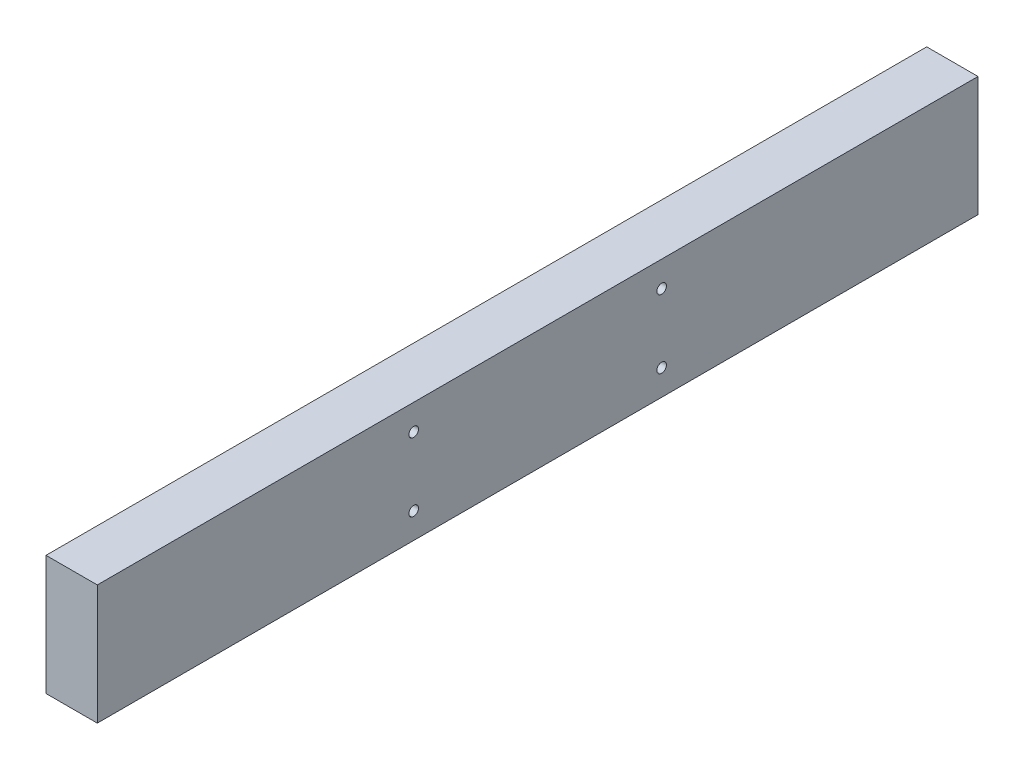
ISO-10303-21;
HEADER;
FILE_DESCRIPTION(('STEP AP214'),'2;1');
FILE_NAME('part.step','',(''),(''),'','','');
FILE_SCHEMA(('AUTOMOTIVE_DESIGN { 1 0 10303 214 1 1 1 1 }'));
ENDSEC;
DATA;
#1=APPLICATION_CONTEXT('core data for automotive mechanical design processes');
#2=APPLICATION_PROTOCOL_DEFINITION('international standard','automotive_design',2000,#1);
#3=PRODUCT_CONTEXT('',#1,'mechanical');
#4=PRODUCT('Part','Part','',(#3));
#5=PRODUCT_RELATED_PRODUCT_CATEGORY('part','',(#4));
#6=PRODUCT_DEFINITION_FORMATION('','',#4);
#7=PRODUCT_DEFINITION_CONTEXT('part definition',#1,'design');
#8=PRODUCT_DEFINITION('design','',#6,#7);
#9=PRODUCT_DEFINITION_SHAPE('','',#8);
#10=(LENGTH_UNIT() NAMED_UNIT(*) SI_UNIT(.MILLI.,.METRE.));
#11=(NAMED_UNIT(*) PLANE_ANGLE_UNIT() SI_UNIT($,.RADIAN.));
#12=(NAMED_UNIT(*) SI_UNIT($,.STERADIAN.) SOLID_ANGLE_UNIT());
#13=UNCERTAINTY_MEASURE_WITH_UNIT(LENGTH_MEASURE(1.E-05),#10,'distance_accuracy_value','');
#14=(GEOMETRIC_REPRESENTATION_CONTEXT(3) GLOBAL_UNCERTAINTY_ASSIGNED_CONTEXT((#13)) GLOBAL_UNIT_ASSIGNED_CONTEXT((#10,
#11,#12)) REPRESENTATION_CONTEXT('',''));
#15=CARTESIAN_POINT('',(0.,0.,0.));
#16=DIRECTION('',(0.,0.,1.));
#17=DIRECTION('',(1.,0.,0.));
#18=AXIS2_PLACEMENT_3D('',#15,#16,#17);
#19=CARTESIAN_POINT('',(19.05,-44.45,654.05));
#20=DIRECTION('',(-1.,0.,0.));
#21=DIRECTION('',(0.,0.,1.));
#22=AXIS2_PLACEMENT_3D('',#19,#20,#21);
#23=PLANE('',#22);
#24=CARTESIAN_POINT('',(19.05,25.4,234.95));
#25=DIRECTION('',(-1.,0.,0.));
#26=DIRECTION('',(0.,0.,1.));
#27=AXIS2_PLACEMENT_3D('',#24,#25,#26);
#28=CIRCLE('',#27,3.57187499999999);
#29=CARTESIAN_POINT('',(19.05,25.4,238.521875));
#30=VERTEX_POINT('',#29);
#31=EDGE_CURVE('E127',#30,#30,#28,.T.);
#32=ORIENTED_EDGE('',*,*,#31,.T.);
#33=EDGE_LOOP('',(#32));
#34=FACE_BOUND('',#33,.T.);
#35=CARTESIAN_POINT('',(19.05,25.4,419.1));
#36=DIRECTION('',(-1.,0.,0.));
#37=DIRECTION('',(0.,0.,1.));
#38=AXIS2_PLACEMENT_3D('',#35,#36,#37);
#39=CIRCLE('',#38,3.57187499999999);
#40=CARTESIAN_POINT('',(19.05,25.4,422.671875));
#41=VERTEX_POINT('',#40);
#42=EDGE_CURVE('E121',#41,#41,#39,.T.);
#43=ORIENTED_EDGE('',*,*,#42,.T.);
#44=EDGE_LOOP('',(#43));
#45=FACE_BOUND('',#44,.T.);
#46=CARTESIAN_POINT('',(19.05,-25.4,419.1));
#47=DIRECTION('',(-1.,0.,0.));
#48=DIRECTION('',(0.,0.,1.));
#49=AXIS2_PLACEMENT_3D('',#46,#47,#48);
#50=CIRCLE('',#49,3.57187499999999);
#51=CARTESIAN_POINT('',(19.05,-25.4,422.671875));
#52=VERTEX_POINT('',#51);
#53=EDGE_CURVE('E115',#52,#52,#50,.T.);
#54=ORIENTED_EDGE('',*,*,#53,.T.);
#55=EDGE_LOOP('',(#54));
#56=FACE_BOUND('',#55,.T.);
#57=CARTESIAN_POINT('',(19.05,-25.4,234.95));
#58=DIRECTION('',(-1.,0.,0.));
#59=DIRECTION('',(0.,0.,1.));
#60=AXIS2_PLACEMENT_3D('',#57,#58,#59);
#61=CIRCLE('',#60,3.57187499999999);
#62=CARTESIAN_POINT('',(19.05,-25.4,238.521875));
#63=VERTEX_POINT('',#62);
#64=EDGE_CURVE('E99',#63,#63,#61,.T.);
#65=ORIENTED_EDGE('',*,*,#64,.T.);
#66=EDGE_LOOP('',(#65));
#67=FACE_BOUND('',#66,.T.);
#68=DIRECTION('',(0.,1.,0.));
#69=VECTOR('',#68,1.);
#70=CARTESIAN_POINT('',(19.05,-44.45,0.));
#71=LINE('',#70,#69);
#72=CARTESIAN_POINT('',(19.05,-44.45,0.));
#73=VERTEX_POINT('',#72);
#74=CARTESIAN_POINT('',(19.05,44.45,0.));
#75=VERTEX_POINT('',#74);
#76=EDGE_CURVE('E96',#73,#75,#71,.T.);
#77=ORIENTED_EDGE('',*,*,#76,.T.);
#78=DIRECTION('',(0.,0.,-1.));
#79=VECTOR('',#78,1.);
#80=CARTESIAN_POINT('',(19.05,44.45,654.05));
#81=LINE('',#80,#79);
#82=CARTESIAN_POINT('',(19.05,44.45,654.05));
#83=VERTEX_POINT('',#82);
#84=EDGE_CURVE('E11',#83,#75,#81,.T.);
#85=ORIENTED_EDGE('',*,*,#84,.F.);
#86=DIRECTION('',(0.,1.,0.));
#87=VECTOR('',#86,1.);
#88=CARTESIAN_POINT('',(19.05,-44.45,654.05));
#89=LINE('',#88,#87);
#90=CARTESIAN_POINT('',(19.05,-44.45,654.05));
#91=VERTEX_POINT('',#90);
#92=EDGE_CURVE('E84',#91,#83,#89,.T.);
#93=ORIENTED_EDGE('',*,*,#92,.F.);
#94=DIRECTION('',(0.,0.,-1.));
#95=VECTOR('',#94,1.);
#96=CARTESIAN_POINT('',(19.05,-44.45,654.05));
#97=LINE('',#96,#95);
#98=EDGE_CURVE('E92',#91,#73,#97,.T.);
#99=ORIENTED_EDGE('',*,*,#98,.T.);
#100=EDGE_LOOP('',(#77,#85,#93,#99));
#101=FACE_BOUND('',#100,.T.);
#102=ADVANCED_FACE('F33',(#34,#45,#56,#67,#101),#23,.F.);
#103=CARTESIAN_POINT('',(-19.05,44.45,654.05));
#104=DIRECTION('',(0.,-1.,0.));
#105=DIRECTION('',(0.,0.,-1.));
#106=AXIS2_PLACEMENT_3D('',#103,#104,#105);
#107=PLANE('',#106);
#108=DIRECTION('',(-1.,0.,0.));
#109=VECTOR('',#108,1.);
#110=CARTESIAN_POINT('',(-19.05,44.45,0.));
#111=LINE('',#110,#109);
#112=CARTESIAN_POINT('',(-19.05,44.45,0.));
#113=VERTEX_POINT('',#112);
#114=EDGE_CURVE('E88',#75,#113,#111,.T.);
#115=ORIENTED_EDGE('',*,*,#114,.T.);
#116=DIRECTION('',(0.,0.,-1.));
#117=VECTOR('',#116,1.);
#118=CARTESIAN_POINT('',(-19.05,44.45,654.05));
#119=LINE('',#118,#117);
#120=CARTESIAN_POINT('',(-19.05,44.45,654.05));
#121=VERTEX_POINT('',#120);
#122=EDGE_CURVE('E41',#121,#113,#119,.T.);
#123=ORIENTED_EDGE('',*,*,#122,.F.);
#124=DIRECTION('',(-1.,0.,0.));
#125=VECTOR('',#124,1.);
#126=CARTESIAN_POINT('',(-19.05,44.45,654.05));
#127=LINE('',#126,#125);
#128=EDGE_CURVE('E79',#83,#121,#127,.T.);
#129=ORIENTED_EDGE('',*,*,#128,.F.);
#130=ORIENTED_EDGE('',*,*,#84,.T.);
#131=EDGE_LOOP('',(#115,#123,#129,#130));
#132=FACE_BOUND('',#131,.T.);
#133=ADVANCED_FACE('F87',(#132),#107,.F.);
#134=CARTESIAN_POINT('',(-19.05,-44.45,654.05));
#135=DIRECTION('',(1.,0.,0.));
#136=DIRECTION('',(0.,0.,-1.));
#137=AXIS2_PLACEMENT_3D('',#134,#135,#136);
#138=PLANE('',#137);
#139=CARTESIAN_POINT('',(-19.05,25.4,234.95));
#140=DIRECTION('',(-1.,0.,0.));
#141=DIRECTION('',(0.,0.,1.));
#142=AXIS2_PLACEMENT_3D('',#139,#140,#141);
#143=CIRCLE('',#142,3.571875);
#144=CARTESIAN_POINT('',(-19.05,25.4,238.521875));
#145=VERTEX_POINT('',#144);
#146=EDGE_CURVE('E130',#145,#145,#143,.T.);
#147=ORIENTED_EDGE('',*,*,#146,.F.);
#148=EDGE_LOOP('',(#147));
#149=FACE_BOUND('',#148,.T.);
#150=CARTESIAN_POINT('',(-19.05,25.4,419.1));
#151=DIRECTION('',(-1.,0.,0.));
#152=DIRECTION('',(0.,0.,1.));
#153=AXIS2_PLACEMENT_3D('',#150,#151,#152);
#154=CIRCLE('',#153,3.571875);
#155=CARTESIAN_POINT('',(-19.05,25.4,422.671875));
#156=VERTEX_POINT('',#155);
#157=EDGE_CURVE('E124',#156,#156,#154,.T.);
#158=ORIENTED_EDGE('',*,*,#157,.F.);
#159=EDGE_LOOP('',(#158));
#160=FACE_BOUND('',#159,.T.);
#161=CARTESIAN_POINT('',(-19.05,-25.4,419.1));
#162=DIRECTION('',(-1.,0.,0.));
#163=DIRECTION('',(0.,0.,1.));
#164=AXIS2_PLACEMENT_3D('',#161,#162,#163);
#165=CIRCLE('',#164,3.571875);
#166=CARTESIAN_POINT('',(-19.05,-25.4,422.671875));
#167=VERTEX_POINT('',#166);
#168=EDGE_CURVE('E118',#167,#167,#165,.T.);
#169=ORIENTED_EDGE('',*,*,#168,.F.);
#170=EDGE_LOOP('',(#169));
#171=FACE_BOUND('',#170,.T.);
#172=CARTESIAN_POINT('',(-19.05,-25.4,234.95));
#173=DIRECTION('',(-1.,0.,0.));
#174=DIRECTION('',(0.,0.,1.));
#175=AXIS2_PLACEMENT_3D('',#172,#173,#174);
#176=CIRCLE('',#175,3.571875);
#177=CARTESIAN_POINT('',(-19.05,-25.4,238.521875));
#178=VERTEX_POINT('',#177);
#179=EDGE_CURVE('E112',#178,#178,#176,.T.);
#180=ORIENTED_EDGE('',*,*,#179,.F.);
#181=EDGE_LOOP('',(#180));
#182=FACE_BOUND('',#181,.T.);
#183=DIRECTION('',(0.,-1.,0.));
#184=VECTOR('',#183,1.);
#185=CARTESIAN_POINT('',(-19.05,-44.45,0.));
#186=LINE('',#185,#184);
#187=CARTESIAN_POINT('',(-19.05,-44.45,0.));
#188=VERTEX_POINT('',#187);
#189=EDGE_CURVE('E66',#113,#188,#186,.T.);
#190=ORIENTED_EDGE('',*,*,#189,.T.);
#191=DIRECTION('',(0.,0.,-1.));
#192=VECTOR('',#191,1.);
#193=CARTESIAN_POINT('',(-19.05,-44.45,654.05));
#194=LINE('',#193,#192);
#195=CARTESIAN_POINT('',(-19.05,-44.45,654.05));
#196=VERTEX_POINT('',#195);
#197=EDGE_CURVE('E89',#196,#188,#194,.T.);
#198=ORIENTED_EDGE('',*,*,#197,.F.);
#199=DIRECTION('',(0.,-1.,0.));
#200=VECTOR('',#199,1.);
#201=CARTESIAN_POINT('',(-19.05,-44.45,654.05));
#202=LINE('',#201,#200);
#203=EDGE_CURVE('E82',#121,#196,#202,.T.);
#204=ORIENTED_EDGE('',*,*,#203,.F.);
#205=ORIENTED_EDGE('',*,*,#122,.T.);
#206=EDGE_LOOP('',(#190,#198,#204,#205));
#207=FACE_BOUND('',#206,.T.);
#208=ADVANCED_FACE('F90',(#149,#160,#171,#182,#207),#138,.F.);
#209=CARTESIAN_POINT('',(-19.05,-44.45,654.05));
#210=DIRECTION('',(0.,1.,0.));
#211=DIRECTION('',(0.,0.,1.));
#212=AXIS2_PLACEMENT_3D('',#209,#210,#211);
#213=PLANE('',#212);
#214=DIRECTION('',(1.,0.,0.));
#215=VECTOR('',#214,1.);
#216=CARTESIAN_POINT('',(-19.05,-44.45,0.));
#217=LINE('',#216,#215);
#218=EDGE_CURVE('E72',#188,#73,#217,.T.);
#219=ORIENTED_EDGE('',*,*,#218,.T.);
#220=ORIENTED_EDGE('',*,*,#98,.F.);
#221=DIRECTION('',(1.,0.,0.));
#222=VECTOR('',#221,1.);
#223=CARTESIAN_POINT('',(-19.05,-44.45,654.05));
#224=LINE('',#223,#222);
#225=EDGE_CURVE('E49',#196,#91,#224,.T.);
#226=ORIENTED_EDGE('',*,*,#225,.F.);
#227=ORIENTED_EDGE('',*,*,#197,.T.);
#228=EDGE_LOOP('',(#219,#220,#226,#227));
#229=FACE_BOUND('',#228,.T.);
#230=ADVANCED_FACE('F104',(#229),#213,.F.);
#231=CARTESIAN_POINT('',(0.,0.,654.05));
#232=DIRECTION('',(0.,0.,-1.));
#233=DIRECTION('',(-1.,0.,0.));
#234=AXIS2_PLACEMENT_3D('',#231,#232,#233);
#235=PLANE('',#234);
#236=ORIENTED_EDGE('',*,*,#92,.T.);
#237=ORIENTED_EDGE('',*,*,#128,.T.);
#238=ORIENTED_EDGE('',*,*,#203,.T.);
#239=ORIENTED_EDGE('',*,*,#225,.T.);
#240=EDGE_LOOP('',(#236,#237,#238,#239));
#241=FACE_BOUND('',#240,.T.);
#242=ADVANCED_FACE('F80',(#241),#235,.F.);
#243=CARTESIAN_POINT('',(0.,0.,0.));
#244=DIRECTION('',(0.,0.,-1.));
#245=DIRECTION('',(-1.,0.,0.));
#246=AXIS2_PLACEMENT_3D('',#243,#244,#245);
#247=PLANE('',#246);
#248=ORIENTED_EDGE('',*,*,#76,.F.);
#249=ORIENTED_EDGE('',*,*,#218,.F.);
#250=ORIENTED_EDGE('',*,*,#189,.F.);
#251=ORIENTED_EDGE('',*,*,#114,.F.);
#252=EDGE_LOOP('',(#248,#249,#250,#251));
#253=FACE_BOUND('',#252,.T.);
#254=ADVANCED_FACE('F107',(#253),#247,.T.);
#255=CARTESIAN_POINT('',(-19.05,-25.4,234.95));
#256=DIRECTION('',(-1.,0.,0.));
#257=DIRECTION('',(0.,0.,1.));
#258=AXIS2_PLACEMENT_3D('',#255,#256,#257);
#259=CYLINDRICAL_SURFACE('',#258,3.57187499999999);
#260=ORIENTED_EDGE('',*,*,#64,.F.);
#261=EDGE_LOOP('',(#260));
#262=FACE_BOUND('',#261,.T.);
#263=ORIENTED_EDGE('',*,*,#179,.T.);
#264=EDGE_LOOP('',(#263));
#265=FACE_BOUND('',#264,.T.);
#266=ADVANCED_FACE('F145',(#262,#265),#259,.F.);
#267=CARTESIAN_POINT('',(-19.05,-25.4,419.1));
#268=DIRECTION('',(-1.,0.,0.));
#269=DIRECTION('',(0.,0.,1.));
#270=AXIS2_PLACEMENT_3D('',#267,#268,#269);
#271=CYLINDRICAL_SURFACE('',#270,3.57187499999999);
#272=ORIENTED_EDGE('',*,*,#53,.F.);
#273=EDGE_LOOP('',(#272));
#274=FACE_BOUND('',#273,.T.);
#275=ORIENTED_EDGE('',*,*,#168,.T.);
#276=EDGE_LOOP('',(#275));
#277=FACE_BOUND('',#276,.T.);
#278=ADVANCED_FACE('F147',(#274,#277),#271,.F.);
#279=CARTESIAN_POINT('',(-19.05,25.4,419.1));
#280=DIRECTION('',(-1.,0.,0.));
#281=DIRECTION('',(0.,0.,1.));
#282=AXIS2_PLACEMENT_3D('',#279,#280,#281);
#283=CYLINDRICAL_SURFACE('',#282,3.57187499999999);
#284=ORIENTED_EDGE('',*,*,#42,.F.);
#285=EDGE_LOOP('',(#284));
#286=FACE_BOUND('',#285,.T.);
#287=ORIENTED_EDGE('',*,*,#157,.T.);
#288=EDGE_LOOP('',(#287));
#289=FACE_BOUND('',#288,.T.);
#290=ADVANCED_FACE('F154',(#286,#289),#283,.F.);
#291=CARTESIAN_POINT('',(-19.05,25.4,234.95));
#292=DIRECTION('',(-1.,0.,0.));
#293=DIRECTION('',(0.,0.,1.));
#294=AXIS2_PLACEMENT_3D('',#291,#292,#293);
#295=CYLINDRICAL_SURFACE('',#294,3.57187499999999);
#296=ORIENTED_EDGE('',*,*,#31,.F.);
#297=EDGE_LOOP('',(#296));
#298=FACE_BOUND('',#297,.T.);
#299=ORIENTED_EDGE('',*,*,#146,.T.);
#300=EDGE_LOOP('',(#299));
#301=FACE_BOUND('',#300,.T.);
#302=ADVANCED_FACE('F134',(#298,#301),#295,.F.);
#303=CLOSED_SHELL('',(#102,#133,#208,#230,#242,#254,#266,#278,#290,#302));
#304=MANIFOLD_SOLID_BREP('B2',#303);
#305=ADVANCED_BREP_SHAPE_REPRESENTATION('',(#18,#304),#14);
#306=SHAPE_DEFINITION_REPRESENTATION(#9,#305);
ENDSEC;
END-ISO-10303-21;
